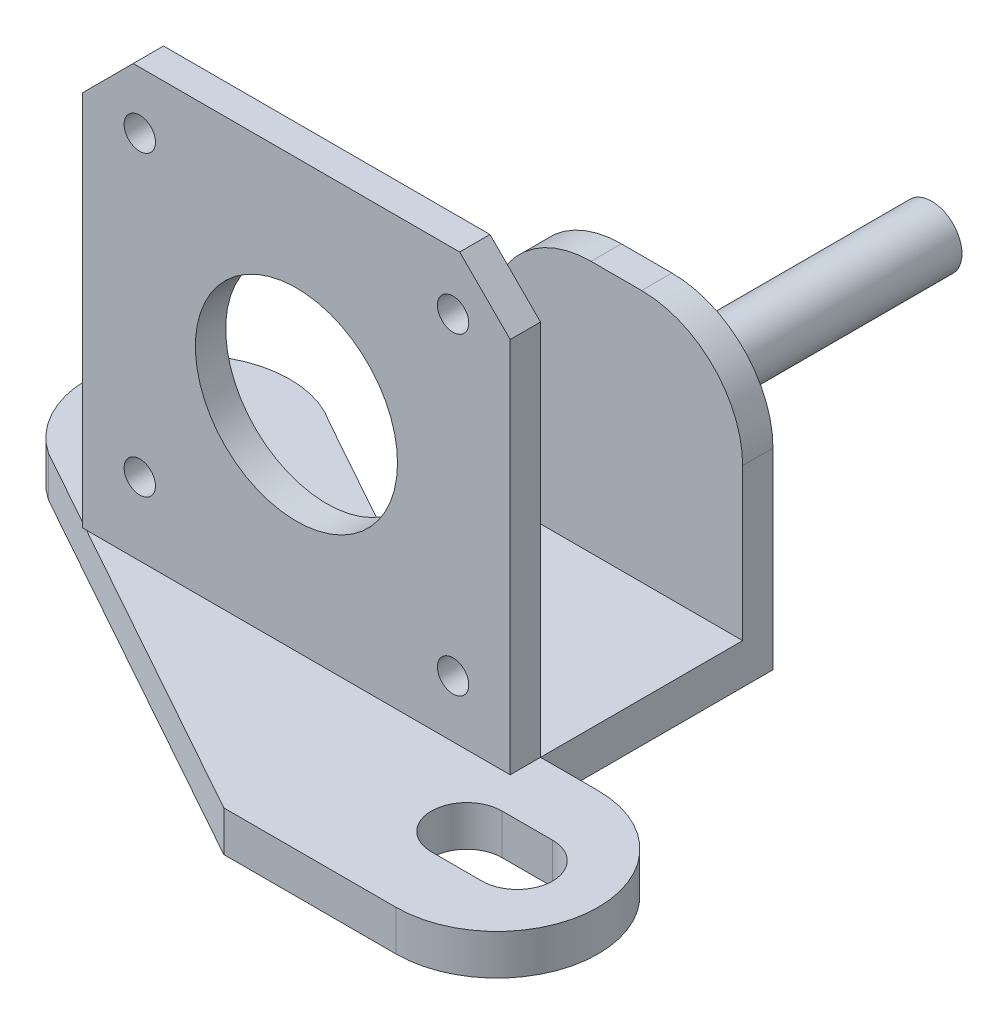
ISO-10303-21;
HEADER;
FILE_DESCRIPTION(('STEP AP214'),'2;1');
FILE_NAME('part.step','',(''),(''),'','','');
FILE_SCHEMA(('AUTOMOTIVE_DESIGN { 1 0 10303 214 1 1 1 1 }'));
ENDSEC;
DATA;
#1=APPLICATION_CONTEXT('core data for automotive mechanical design processes');
#2=APPLICATION_PROTOCOL_DEFINITION('international standard','automotive_design',2000,#1);
#3=PRODUCT_CONTEXT('',#1,'mechanical');
#4=PRODUCT('Part','Part','',(#3));
#5=PRODUCT_RELATED_PRODUCT_CATEGORY('part','',(#4));
#6=PRODUCT_DEFINITION_FORMATION('','',#4);
#7=PRODUCT_DEFINITION_CONTEXT('part definition',#1,'design');
#8=PRODUCT_DEFINITION('design','',#6,#7);
#9=PRODUCT_DEFINITION_SHAPE('','',#8);
#10=(LENGTH_UNIT() NAMED_UNIT(*) SI_UNIT(.MILLI.,.METRE.));
#11=(NAMED_UNIT(*) PLANE_ANGLE_UNIT() SI_UNIT($,.RADIAN.));
#12=(NAMED_UNIT(*) SI_UNIT($,.STERADIAN.) SOLID_ANGLE_UNIT());
#13=UNCERTAINTY_MEASURE_WITH_UNIT(LENGTH_MEASURE(1.E-05),#10,'distance_accuracy_value','');
#14=(GEOMETRIC_REPRESENTATION_CONTEXT(3) GLOBAL_UNCERTAINTY_ASSIGNED_CONTEXT((#13)) GLOBAL_UNIT_ASSIGNED_CONTEXT((#10,
#11,#12)) REPRESENTATION_CONTEXT('',''));
#15=CARTESIAN_POINT('',(0.,0.,0.));
#16=DIRECTION('',(0.,0.,1.));
#17=DIRECTION('',(1.,0.,0.));
#18=AXIS2_PLACEMENT_3D('',#15,#16,#17);
#19=CARTESIAN_POINT('',(8.14999999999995,40.65,3.));
#20=DIRECTION('',(0.,0.,1.));
#21=DIRECTION('',(1.,0.,0.));
#22=AXIS2_PLACEMENT_3D('',#19,#20,#21);
#23=CYLINDRICAL_SURFACE('',#22,1.55000000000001);
#24=CARTESIAN_POINT('',(8.14999999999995,40.65,10.));
#25=DIRECTION('',(0.,0.,1.));
#26=DIRECTION('',(1.,0.,0.));
#27=AXIS2_PLACEMENT_3D('',#24,#25,#26);
#28=CIRCLE('',#27,1.55000000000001);
#29=CARTESIAN_POINT('',(9.69999999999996,40.65,10.));
#30=VERTEX_POINT('',#29);
#31=EDGE_CURVE('E260',#30,#30,#28,.F.);
#32=ORIENTED_EDGE('',*,*,#31,.T.);
#33=EDGE_LOOP('',(#32));
#34=FACE_BOUND('',#33,.T.);
#35=CARTESIAN_POINT('',(8.14999999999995,40.65,13.));
#36=DIRECTION('',(0.,0.,1.));
#37=DIRECTION('',(1.,0.,0.));
#38=AXIS2_PLACEMENT_3D('',#35,#36,#37);
#39=CIRCLE('',#38,1.55000000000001);
#40=CARTESIAN_POINT('',(9.69999999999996,40.65,13.));
#41=VERTEX_POINT('',#40);
#42=EDGE_CURVE('E167',#41,#41,#39,.T.);
#43=ORIENTED_EDGE('',*,*,#42,.T.);
#44=EDGE_LOOP('',(#43));
#45=FACE_BOUND('',#44,.T.);
#46=ADVANCED_FACE('F17',(#34,#45),#23,.F.);
#47=CARTESIAN_POINT('',(23.65,25.15,3.));
#48=DIRECTION('',(0.,0.,1.));
#49=DIRECTION('',(1.,0.,0.));
#50=AXIS2_PLACEMENT_3D('',#47,#48,#49);
#51=CYLINDRICAL_SURFACE('',#50,9.99999999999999);
#52=CARTESIAN_POINT('',(23.65,25.15,10.));
#53=DIRECTION('',(0.,0.,1.));
#54=DIRECTION('',(1.,0.,0.));
#55=AXIS2_PLACEMENT_3D('',#52,#53,#54);
#56=CIRCLE('',#55,9.99999999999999);
#57=CARTESIAN_POINT('',(33.65,25.15,10.));
#58=VERTEX_POINT('',#57);
#59=EDGE_CURVE('E257',#58,#58,#56,.F.);
#60=ORIENTED_EDGE('',*,*,#59,.T.);
#61=EDGE_LOOP('',(#60));
#62=FACE_BOUND('',#61,.T.);
#63=CARTESIAN_POINT('',(23.65,25.15,13.));
#64=DIRECTION('',(0.,0.,1.));
#65=DIRECTION('',(1.,0.,0.));
#66=AXIS2_PLACEMENT_3D('',#63,#64,#65);
#67=CIRCLE('',#66,9.99999999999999);
#68=CARTESIAN_POINT('',(33.65,25.15,13.));
#69=VERTEX_POINT('',#68);
#70=EDGE_CURVE('E265',#69,#69,#67,.T.);
#71=ORIENTED_EDGE('',*,*,#70,.T.);
#72=EDGE_LOOP('',(#71));
#73=FACE_BOUND('',#72,.T.);
#74=ADVANCED_FACE('F604',(#62,#73),#51,.F.);
#75=CARTESIAN_POINT('',(39.1499999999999,9.64999999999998,3.));
#76=DIRECTION('',(0.,0.,1.));
#77=DIRECTION('',(1.,0.,0.));
#78=AXIS2_PLACEMENT_3D('',#75,#76,#77);
#79=CYLINDRICAL_SURFACE('',#78,1.55000000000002);
#80=CARTESIAN_POINT('',(39.1499999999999,9.64999999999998,10.));
#81=DIRECTION('',(0.,0.,1.));
#82=DIRECTION('',(1.,0.,0.));
#83=AXIS2_PLACEMENT_3D('',#80,#81,#82);
#84=CIRCLE('',#83,1.55000000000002);
#85=CARTESIAN_POINT('',(40.7,9.64999999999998,10.));
#86=VERTEX_POINT('',#85);
#87=EDGE_CURVE('E254',#86,#86,#84,.F.);
#88=ORIENTED_EDGE('',*,*,#87,.T.);
#89=EDGE_LOOP('',(#88));
#90=FACE_BOUND('',#89,.T.);
#91=CARTESIAN_POINT('',(39.1499999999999,9.64999999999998,13.));
#92=DIRECTION('',(0.,0.,1.));
#93=DIRECTION('',(1.,0.,0.));
#94=AXIS2_PLACEMENT_3D('',#91,#92,#93);
#95=CIRCLE('',#94,1.55000000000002);
#96=CARTESIAN_POINT('',(40.7,9.64999999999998,13.));
#97=VERTEX_POINT('',#96);
#98=EDGE_CURVE('E268',#97,#97,#95,.T.);
#99=ORIENTED_EDGE('',*,*,#98,.T.);
#100=EDGE_LOOP('',(#99));
#101=FACE_BOUND('',#100,.T.);
#102=ADVANCED_FACE('F601',(#90,#101),#79,.F.);
#103=CARTESIAN_POINT('',(39.1499999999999,40.65,3.));
#104=DIRECTION('',(0.,0.,1.));
#105=DIRECTION('',(1.,0.,0.));
#106=AXIS2_PLACEMENT_3D('',#103,#104,#105);
#107=CYLINDRICAL_SURFACE('',#106,1.55000000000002);
#108=CARTESIAN_POINT('',(39.1499999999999,40.65,10.));
#109=DIRECTION('',(0.,0.,1.));
#110=DIRECTION('',(1.,0.,0.));
#111=AXIS2_PLACEMENT_3D('',#108,#109,#110);
#112=CIRCLE('',#111,1.55000000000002);
#113=CARTESIAN_POINT('',(40.7,40.65,10.));
#114=VERTEX_POINT('',#113);
#115=EDGE_CURVE('E251',#114,#114,#112,.F.);
#116=ORIENTED_EDGE('',*,*,#115,.T.);
#117=EDGE_LOOP('',(#116));
#118=FACE_BOUND('',#117,.T.);
#119=CARTESIAN_POINT('',(39.1499999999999,40.65,13.));
#120=DIRECTION('',(0.,0.,1.));
#121=DIRECTION('',(1.,0.,0.));
#122=AXIS2_PLACEMENT_3D('',#119,#120,#121);
#123=CIRCLE('',#122,1.55000000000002);
#124=CARTESIAN_POINT('',(40.7,40.65,13.));
#125=VERTEX_POINT('',#124);
#126=EDGE_CURVE('E270',#125,#125,#123,.T.);
#127=ORIENTED_EDGE('',*,*,#126,.T.);
#128=EDGE_LOOP('',(#127));
#129=FACE_BOUND('',#128,.T.);
#130=ADVANCED_FACE('F597',(#118,#129),#107,.F.);
#131=CARTESIAN_POINT('',(8.14999999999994,11.2,3.));
#132=DIRECTION('',(0.,0.,1.));
#133=DIRECTION('',(1.,0.,0.));
#134=AXIS2_PLACEMENT_3D('',#131,#132,#133);
#135=CYLINDRICAL_SURFACE('',#134,1.55000000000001);
#136=CARTESIAN_POINT('',(8.14999999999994,11.2,10.));
#137=DIRECTION('',(0.,0.,1.));
#138=DIRECTION('',(1.,0.,0.));
#139=AXIS2_PLACEMENT_3D('',#136,#137,#138);
#140=CIRCLE('',#139,1.55000000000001);
#141=CARTESIAN_POINT('',(9.69999999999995,11.2,10.));
#142=VERTEX_POINT('',#141);
#143=EDGE_CURVE('E248',#142,#142,#140,.F.);
#144=ORIENTED_EDGE('',*,*,#143,.T.);
#145=EDGE_LOOP('',(#144));
#146=FACE_BOUND('',#145,.T.);
#147=CARTESIAN_POINT('',(8.14999999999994,11.2,13.));
#148=DIRECTION('',(0.,0.,1.));
#149=DIRECTION('',(1.,0.,0.));
#150=AXIS2_PLACEMENT_3D('',#147,#148,#149);
#151=CIRCLE('',#150,1.55000000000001);
#152=CARTESIAN_POINT('',(9.69999999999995,11.2,13.));
#153=VERTEX_POINT('',#152);
#154=EDGE_CURVE('E20',#153,#153,#151,.T.);
#155=ORIENTED_EDGE('',*,*,#154,.T.);
#156=EDGE_LOOP('',(#155));
#157=FACE_BOUND('',#156,.T.);
#158=ADVANCED_FACE('F594',(#146,#157),#135,.F.);
#159=CARTESIAN_POINT('',(39.8,46.3,0.));
#160=DIRECTION('',(-0.707106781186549,-0.707106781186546,0.));
#161=DIRECTION('',(0.707106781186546,-0.707106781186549,0.));
#162=AXIS2_PLACEMENT_3D('',#159,#160,#161);
#163=PLANE('',#162);
#164=DIRECTION('',(0.,0.,1.));
#165=VECTOR('',#164,1.);
#166=CARTESIAN_POINT('',(44.8,41.3,10.));
#167=LINE('',#166,#165);
#168=CARTESIAN_POINT('',(44.8,41.3,13.));
#169=VERTEX_POINT('',#168);
#170=CARTESIAN_POINT('',(44.8,41.3,10.));
#171=VERTEX_POINT('',#170);
#172=EDGE_CURVE('E275',#169,#171,#167,.F.);
#173=ORIENTED_EDGE('',*,*,#172,.T.);
#174=DIRECTION('',(-0.707106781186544,0.70710678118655,0.));
#175=VECTOR('',#174,1.);
#176=CARTESIAN_POINT('',(44.8,41.3,10.));
#177=LINE('',#176,#175);
#178=CARTESIAN_POINT('',(39.8,46.3,10.));
#179=VERTEX_POINT('',#178);
#180=EDGE_CURVE('E173',#171,#179,#177,.T.);
#181=ORIENTED_EDGE('',*,*,#180,.T.);
#182=DIRECTION('',(0.,0.,-1.));
#183=VECTOR('',#182,1.);
#184=CARTESIAN_POINT('',(39.8,46.3,0.));
#185=LINE('',#184,#183);
#186=CARTESIAN_POINT('',(39.8,46.3,13.));
#187=VERTEX_POINT('',#186);
#188=EDGE_CURVE('E171',#179,#187,#185,.F.);
#189=ORIENTED_EDGE('',*,*,#188,.T.);
#190=DIRECTION('',(0.707106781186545,-0.70710678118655,0.));
#191=VECTOR('',#190,1.);
#192=CARTESIAN_POINT('',(39.8,46.3,13.));
#193=LINE('',#192,#191);
#194=EDGE_CURVE('E155',#187,#169,#193,.T.);
#195=ORIENTED_EDGE('',*,*,#194,.T.);
#196=EDGE_LOOP('',(#173,#181,#189,#195));
#197=FACE_BOUND('',#196,.T.);
#198=ADVANCED_FACE('F172',(#197),#163,.F.);
#199=CARTESIAN_POINT('',(0.,46.3,0.));
#200=DIRECTION('',(0.,-1.,0.));
#201=DIRECTION('',(0.,0.,-1.));
#202=AXIS2_PLACEMENT_3D('',#199,#200,#201);
#203=PLANE('',#202);
#204=DIRECTION('',(0.,0.,1.));
#205=VECTOR('',#204,1.);
#206=CARTESIAN_POINT('',(7.49999999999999,46.3,0.));
#207=LINE('',#206,#205);
#208=CARTESIAN_POINT('',(7.49999999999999,46.3,10.));
#209=VERTEX_POINT('',#208);
#210=CARTESIAN_POINT('',(7.49999999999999,46.3,13.));
#211=VERTEX_POINT('',#210);
#212=EDGE_CURVE('E177',#209,#211,#207,.T.);
#213=ORIENTED_EDGE('',*,*,#212,.T.);
#214=DIRECTION('',(-1.,0.,0.));
#215=VECTOR('',#214,1.);
#216=CARTESIAN_POINT('',(44.8,46.3,13.));
#217=LINE('',#216,#215);
#218=EDGE_CURVE('E160',#211,#187,#217,.F.);
#219=ORIENTED_EDGE('',*,*,#218,.T.);
#220=ORIENTED_EDGE('',*,*,#188,.F.);
#221=DIRECTION('',(1.,0.,0.));
#222=VECTOR('',#221,1.);
#223=CARTESIAN_POINT('',(0.,46.3,10.));
#224=LINE('',#223,#222);
#225=EDGE_CURVE('E288',#179,#209,#224,.F.);
#226=ORIENTED_EDGE('',*,*,#225,.T.);
#227=EDGE_LOOP('',(#213,#219,#220,#226));
#228=FACE_BOUND('',#227,.T.);
#229=ADVANCED_FACE('F179',(#228),#203,.F.);
#230=CARTESIAN_POINT('',(7.49999999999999,46.3,0.));
#231=DIRECTION('',(0.70710678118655,-0.707106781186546,0.));
#232=DIRECTION('',(0.707106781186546,0.70710678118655,0.));
#233=AXIS2_PLACEMENT_3D('',#230,#231,#232);
#234=PLANE('',#233);
#235=DIRECTION('',(0.,0.,-1.));
#236=VECTOR('',#235,1.);
#237=CARTESIAN_POINT('',(2.5,41.3,13.));
#238=LINE('',#237,#236);
#239=CARTESIAN_POINT('',(2.5,41.3,10.));
#240=VERTEX_POINT('',#239);
#241=CARTESIAN_POINT('',(2.5,41.3,13.));
#242=VERTEX_POINT('',#241);
#243=EDGE_CURVE('E180',#240,#242,#238,.F.);
#244=ORIENTED_EDGE('',*,*,#243,.T.);
#245=DIRECTION('',(0.707106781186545,0.70710678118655,0.));
#246=VECTOR('',#245,1.);
#247=CARTESIAN_POINT('',(2.5,41.3,13.));
#248=LINE('',#247,#246);
#249=EDGE_CURVE('E181',#242,#211,#248,.T.);
#250=ORIENTED_EDGE('',*,*,#249,.T.);
#251=ORIENTED_EDGE('',*,*,#212,.F.);
#252=DIRECTION('',(-0.707106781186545,-0.707106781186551,0.));
#253=VECTOR('',#252,1.);
#254=CARTESIAN_POINT('',(7.49999999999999,46.3,10.));
#255=LINE('',#254,#253);
#256=EDGE_CURVE('E293',#209,#240,#255,.T.);
#257=ORIENTED_EDGE('',*,*,#256,.T.);
#258=EDGE_LOOP('',(#244,#250,#251,#257));
#259=FACE_BOUND('',#258,.T.);
#260=ADVANCED_FACE('F314',(#259),#234,.F.);
#261=CARTESIAN_POINT('',(35.49872900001,20.000000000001,-38.));
#262=DIRECTION('',(0.,0.,-1.));
#263=DIRECTION('',(-1.,0.,0.));
#264=AXIS2_PLACEMENT_3D('',#261,#262,#263);
#265=PLANE('',#264);
#266=CARTESIAN_POINT('',(35.49872900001,20.000000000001,-38.));
#267=DIRECTION('',(0.,0.,1.));
#268=DIRECTION('',(1.,0.,0.));
#269=AXIS2_PLACEMENT_3D('',#266,#267,#268);
#270=CIRCLE('',#269,3.);
#271=CARTESIAN_POINT('',(38.49872900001,20.000000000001,-38.));
#272=VERTEX_POINT('',#271);
#273=EDGE_CURVE('E244',#272,#272,#270,.T.);
#274=ORIENTED_EDGE('',*,*,#273,.F.);
#275=EDGE_LOOP('',(#274));
#276=FACE_BOUND('',#275,.T.);
#277=ADVANCED_FACE('F583',(#276),#265,.T.);
#278=CARTESIAN_POINT('',(44.8,46.3,10.));
#279=DIRECTION('',(-1.,0.,0.));
#280=DIRECTION('',(0.,0.,1.));
#281=AXIS2_PLACEMENT_3D('',#278,#279,#280);
#282=PLANE('',#281);
#283=ORIENTED_EDGE('',*,*,#172,.F.);
#284=DIRECTION('',(0.,1.,0.));
#285=VECTOR('',#284,1.);
#286=CARTESIAN_POINT('',(44.8,46.3,13.));
#287=LINE('',#286,#285);
#288=CARTESIAN_POINT('',(44.8,4.,13.));
#289=VERTEX_POINT('',#288);
#290=EDGE_CURVE('E164',#169,#289,#287,.F.);
#291=ORIENTED_EDGE('',*,*,#290,.T.);
#292=DIRECTION('',(0.,0.,1.));
#293=VECTOR('',#292,1.);
#294=CARTESIAN_POINT('',(44.8,4.,0.));
#295=LINE('',#294,#293);
#296=CARTESIAN_POINT('',(44.8,4.,10.));
#297=VERTEX_POINT('',#296);
#298=EDGE_CURVE('E360',#297,#289,#295,.T.);
#299=ORIENTED_EDGE('',*,*,#298,.F.);
#300=DIRECTION('',(0.,1.,0.));
#301=VECTOR('',#300,1.);
#302=CARTESIAN_POINT('',(44.8,4.,10.));
#303=LINE('',#302,#301);
#304=EDGE_CURVE('E328',#297,#171,#303,.T.);
#305=ORIENTED_EDGE('',*,*,#304,.T.);
#306=EDGE_LOOP('',(#283,#291,#299,#305));
#307=FACE_BOUND('',#306,.T.);
#308=ADVANCED_FACE('F580',(#307),#282,.F.);
#309=CARTESIAN_POINT('',(44.8,46.3,13.));
#310=DIRECTION('',(0.,0.,-1.));
#311=DIRECTION('',(-1.,0.,0.));
#312=AXIS2_PLACEMENT_3D('',#309,#310,#311);
#313=PLANE('',#312);
#314=ORIENTED_EDGE('',*,*,#249,.F.);
#315=DIRECTION('',(0.,1.,0.));
#316=VECTOR('',#315,1.);
#317=CARTESIAN_POINT('',(2.5,46.3,13.));
#318=LINE('',#317,#316);
#319=CARTESIAN_POINT('',(2.5,4.,13.));
#320=VERTEX_POINT('',#319);
#321=EDGE_CURVE('E128',#242,#320,#318,.F.);
#322=ORIENTED_EDGE('',*,*,#321,.T.);
#323=DIRECTION('',(1.,0.,0.));
#324=VECTOR('',#323,1.);
#325=CARTESIAN_POINT('',(0.,4.,13.));
#326=LINE('',#325,#324);
#327=CARTESIAN_POINT('',(2.88010316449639,4.,13.));
#328=VERTEX_POINT('',#327);
#329=EDGE_CURVE('E247',#328,#320,#326,.F.);
#330=ORIENTED_EDGE('',*,*,#329,.F.);
#331=DIRECTION('',(1.,0.,0.));
#332=VECTOR('',#331,1.);
#333=CARTESIAN_POINT('',(0.,4.,13.));
#334=LINE('',#333,#332);
#335=EDGE_CURVE('E357',#289,#328,#334,.F.);
#336=ORIENTED_EDGE('',*,*,#335,.F.);
#337=ORIENTED_EDGE('',*,*,#290,.F.);
#338=ORIENTED_EDGE('',*,*,#194,.F.);
#339=ORIENTED_EDGE('',*,*,#218,.F.);
#340=EDGE_LOOP('',(#314,#322,#330,#336,#337,#338,#339));
#341=FACE_BOUND('',#340,.T.);
#342=ORIENTED_EDGE('',*,*,#42,.F.);
#343=EDGE_LOOP('',(#342));
#344=FACE_BOUND('',#343,.T.);
#345=ORIENTED_EDGE('',*,*,#70,.F.);
#346=EDGE_LOOP('',(#345));
#347=FACE_BOUND('',#346,.T.);
#348=ORIENTED_EDGE('',*,*,#98,.F.);
#349=EDGE_LOOP('',(#348));
#350=FACE_BOUND('',#349,.T.);
#351=ORIENTED_EDGE('',*,*,#126,.F.);
#352=EDGE_LOOP('',(#351));
#353=FACE_BOUND('',#352,.T.);
#354=ORIENTED_EDGE('',*,*,#154,.F.);
#355=EDGE_LOOP('',(#354));
#356=FACE_BOUND('',#355,.T.);
#357=ADVANCED_FACE('F157',(#341,#344,#347,#350,#353,#356),#313,.F.);
#358=CARTESIAN_POINT('',(2.5,46.3,13.));
#359=DIRECTION('',(1.,0.,0.));
#360=DIRECTION('',(0.,0.,-1.));
#361=AXIS2_PLACEMENT_3D('',#358,#359,#360);
#362=PLANE('',#361);
#363=ORIENTED_EDGE('',*,*,#243,.F.);
#364=DIRECTION('',(0.,1.,0.));
#365=VECTOR('',#364,1.);
#366=CARTESIAN_POINT('',(2.5,4.,10.));
#367=LINE('',#366,#365);
#368=CARTESIAN_POINT('',(2.5,4.,10.));
#369=VERTEX_POINT('',#368);
#370=EDGE_CURVE('E296',#240,#369,#367,.F.);
#371=ORIENTED_EDGE('',*,*,#370,.T.);
#372=DIRECTION('',(0.,0.,1.));
#373=VECTOR('',#372,1.);
#374=CARTESIAN_POINT('',(2.5,4.,0.));
#375=LINE('',#374,#373);
#376=CARTESIAN_POINT('',(2.5,4.,12.7887300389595));
#377=VERTEX_POINT('',#376);
#378=EDGE_CURVE('E334',#377,#369,#375,.F.);
#379=ORIENTED_EDGE('',*,*,#378,.F.);
#380=DIRECTION('',(0.,0.,-1.));
#381=VECTOR('',#380,1.);
#382=CARTESIAN_POINT('',(2.5,4.,0.));
#383=LINE('',#382,#381);
#384=EDGE_CURVE('E320',#320,#377,#383,.T.);
#385=ORIENTED_EDGE('',*,*,#384,.F.);
#386=ORIENTED_EDGE('',*,*,#321,.F.);
#387=EDGE_LOOP('',(#363,#371,#379,#385,#386));
#388=FACE_BOUND('',#387,.T.);
#389=ADVANCED_FACE('F317',(#388),#362,.F.);
#390=CARTESIAN_POINT('',(0.,4.,10.));
#391=DIRECTION('',(0.,0.,1.));
#392=DIRECTION('',(1.,0.,0.));
#393=AXIS2_PLACEMENT_3D('',#390,#391,#392);
#394=PLANE('',#393);
#395=DIRECTION('',(1.,0.,0.));
#396=VECTOR('',#395,1.);
#397=CARTESIAN_POINT('',(0.,4.,10.));
#398=LINE('',#397,#396);
#399=EDGE_CURVE('E236',#369,#297,#398,.T.);
#400=ORIENTED_EDGE('',*,*,#399,.F.);
#401=ORIENTED_EDGE('',*,*,#370,.F.);
#402=ORIENTED_EDGE('',*,*,#256,.F.);
#403=ORIENTED_EDGE('',*,*,#225,.F.);
#404=ORIENTED_EDGE('',*,*,#180,.F.);
#405=ORIENTED_EDGE('',*,*,#304,.F.);
#406=EDGE_LOOP('',(#400,#401,#402,#403,#404,#405));
#407=FACE_BOUND('',#406,.T.);
#408=ORIENTED_EDGE('',*,*,#143,.F.);
#409=EDGE_LOOP('',(#408));
#410=FACE_BOUND('',#409,.T.);
#411=ORIENTED_EDGE('',*,*,#115,.F.);
#412=EDGE_LOOP('',(#411));
#413=FACE_BOUND('',#412,.T.);
#414=ORIENTED_EDGE('',*,*,#87,.F.);
#415=EDGE_LOOP('',(#414));
#416=FACE_BOUND('',#415,.T.);
#417=ORIENTED_EDGE('',*,*,#59,.F.);
#418=EDGE_LOOP('',(#417));
#419=FACE_BOUND('',#418,.T.);
#420=ORIENTED_EDGE('',*,*,#31,.F.);
#421=EDGE_LOOP('',(#420));
#422=FACE_BOUND('',#421,.T.);
#423=ADVANCED_FACE('F308',(#407,#410,#413,#416,#419,#422),#394,.F.);
#424=CARTESIAN_POINT('',(0.,4.,0.));
#425=DIRECTION('',(0.,-1.,0.));
#426=DIRECTION('',(0.,0.,-1.));
#427=AXIS2_PLACEMENT_3D('',#424,#425,#426);
#428=PLANE('',#427);
#429=DIRECTION('',(-0.874058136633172,0.,-0.485821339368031));
#430=VECTOR('',#429,1.);
#431=CARTESIAN_POINT('',(-4.84050044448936,4.,8.70871338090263));
#432=LINE('',#431,#430);
#433=EDGE_CURVE('E343',#377,#328,#432,.F.);
#434=ORIENTED_EDGE('',*,*,#433,.T.);
#435=ORIENTED_EDGE('',*,*,#329,.T.);
#436=ORIENTED_EDGE('',*,*,#384,.T.);
#437=EDGE_LOOP('',(#434,#435,#436));
#438=FACE_BOUND('',#437,.T.);
#439=ADVANCED_FACE('F569',(#438),#428,.T.);
#440=CARTESIAN_POINT('',(35.49872900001,20.000000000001,-38.));
#441=DIRECTION('',(0.,0.,1.));
#442=DIRECTION('',(1.,0.,0.));
#443=AXIS2_PLACEMENT_3D('',#440,#441,#442);
#444=CYLINDRICAL_SURFACE('',#443,3.);
#445=CARTESIAN_POINT('',(35.49872900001,20.000000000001,-13.));
#446=DIRECTION('',(0.,0.,1.));
#447=DIRECTION('',(1.,0.,0.));
#448=AXIS2_PLACEMENT_3D('',#445,#446,#447);
#449=CIRCLE('',#448,3.);
#450=CARTESIAN_POINT('',(38.4987290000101,20.000000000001,-13.));
#451=VERTEX_POINT('',#450);
#452=EDGE_CURVE('E225',#451,#451,#449,.T.);
#453=ORIENTED_EDGE('',*,*,#452,.F.);
#454=EDGE_LOOP('',(#453));
#455=FACE_BOUND('',#454,.T.);
#456=ORIENTED_EDGE('',*,*,#273,.T.);
#457=EDGE_LOOP('',(#456));
#458=FACE_BOUND('',#457,.T.);
#459=ADVANCED_FACE('F565',(#455,#458),#444,.T.);
#460=CARTESIAN_POINT('',(0.,29.,0.));
#461=DIRECTION('',(0.,1.,0.));
#462=DIRECTION('',(0.,0.,1.));
#463=AXIS2_PLACEMENT_3D('',#460,#461,#462);
#464=PLANE('',#463);
#465=DIRECTION('',(-1.,0.,0.));
#466=VECTOR('',#465,1.);
#467=CARTESIAN_POINT('',(19.8,29.,-9.99999999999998));
#468=LINE('',#467,#466);
#469=CARTESIAN_POINT('',(29.8,29.,-9.99999999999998));
#470=VERTEX_POINT('',#469);
#471=CARTESIAN_POINT('',(34.8,29.,-9.99999999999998));
#472=VERTEX_POINT('',#471);
#473=EDGE_CURVE('E240',#470,#472,#468,.F.);
#474=ORIENTED_EDGE('',*,*,#473,.T.);
#475=DIRECTION('',(0.,0.,1.));
#476=VECTOR('',#475,1.);
#477=CARTESIAN_POINT('',(34.8,29.,0.));
#478=LINE('',#477,#476);
#479=CARTESIAN_POINT('',(34.8,29.,-13.));
#480=VERTEX_POINT('',#479);
#481=EDGE_CURVE('E119',#480,#472,#478,.T.);
#482=ORIENTED_EDGE('',*,*,#481,.F.);
#483=DIRECTION('',(-1.,0.,0.));
#484=VECTOR('',#483,1.);
#485=CARTESIAN_POINT('',(0.,29.,-13.));
#486=LINE('',#485,#484);
#487=CARTESIAN_POINT('',(29.8,29.,-13.));
#488=VERTEX_POINT('',#487);
#489=EDGE_CURVE('E221',#488,#480,#486,.F.);
#490=ORIENTED_EDGE('',*,*,#489,.F.);
#491=DIRECTION('',(0.,0.,-1.));
#492=VECTOR('',#491,1.);
#493=CARTESIAN_POINT('',(29.8,29.,0.));
#494=LINE('',#493,#492);
#495=EDGE_CURVE('E243',#470,#488,#494,.T.);
#496=ORIENTED_EDGE('',*,*,#495,.F.);
#497=EDGE_LOOP('',(#474,#482,#490,#496));
#498=FACE_BOUND('',#497,.T.);
#499=ADVANCED_FACE('F562',(#498),#464,.T.);
#500=CARTESIAN_POINT('',(34.8,19.,0.));
#501=DIRECTION('',(0.,0.,1.));
#502=DIRECTION('',(1.,0.,0.));
#503=AXIS2_PLACEMENT_3D('',#500,#501,#502);
#504=CYLINDRICAL_SURFACE('',#503,10.);
#505=CARTESIAN_POINT('',(34.8,19.,-13.));
#506=DIRECTION('',(0.,0.,1.));
#507=DIRECTION('',(1.,0.,0.));
#508=AXIS2_PLACEMENT_3D('',#505,#506,#507);
#509=CIRCLE('',#508,10.);
#510=CARTESIAN_POINT('',(44.8,19.,-13.));
#511=VERTEX_POINT('',#510);
#512=EDGE_CURVE('E218',#480,#511,#509,.F.);
#513=ORIENTED_EDGE('',*,*,#512,.F.);
#514=ORIENTED_EDGE('',*,*,#481,.T.);
#515=CARTESIAN_POINT('',(34.8,19.,-9.99999999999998));
#516=DIRECTION('',(0.,0.,1.));
#517=DIRECTION('',(1.,0.,0.));
#518=AXIS2_PLACEMENT_3D('',#515,#516,#517);
#519=CIRCLE('',#518,10.);
#520=CARTESIAN_POINT('',(44.8,19.,-9.99999999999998));
#521=VERTEX_POINT('',#520);
#522=EDGE_CURVE('E241',#472,#521,#519,.F.);
#523=ORIENTED_EDGE('',*,*,#522,.T.);
#524=DIRECTION('',(0.,0.,1.));
#525=VECTOR('',#524,1.);
#526=CARTESIAN_POINT('',(44.8,19.,-13.));
#527=LINE('',#526,#525);
#528=EDGE_CURVE('E228',#521,#511,#527,.F.);
#529=ORIENTED_EDGE('',*,*,#528,.T.);
#530=EDGE_LOOP('',(#513,#514,#523,#529));
#531=FACE_BOUND('',#530,.T.);
#532=ADVANCED_FACE('F558',(#531),#504,.T.);
#533=CARTESIAN_POINT('',(29.8,19.,0.));
#534=DIRECTION('',(0.,0.,-1.));
#535=DIRECTION('',(-1.,0.,0.));
#536=AXIS2_PLACEMENT_3D('',#533,#534,#535);
#537=CYLINDRICAL_SURFACE('',#536,10.);
#538=CARTESIAN_POINT('',(29.8,19.,-9.99999999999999));
#539=DIRECTION('',(0.,0.,-1.));
#540=DIRECTION('',(-1.,0.,0.));
#541=AXIS2_PLACEMENT_3D('',#538,#539,#540);
#542=CIRCLE('',#541,10.);
#543=CARTESIAN_POINT('',(19.8,19.,-9.99999999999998));
#544=VERTEX_POINT('',#543);
#545=EDGE_CURVE('E237',#544,#470,#542,.T.);
#546=ORIENTED_EDGE('',*,*,#545,.T.);
#547=ORIENTED_EDGE('',*,*,#495,.T.);
#548=CARTESIAN_POINT('',(29.8,19.,-13.));
#549=DIRECTION('',(0.,0.,-1.));
#550=DIRECTION('',(-1.,0.,0.));
#551=AXIS2_PLACEMENT_3D('',#548,#549,#550);
#552=CIRCLE('',#551,10.);
#553=CARTESIAN_POINT('',(19.8,19.,-13.));
#554=VERTEX_POINT('',#553);
#555=EDGE_CURVE('E222',#554,#488,#552,.T.);
#556=ORIENTED_EDGE('',*,*,#555,.F.);
#557=DIRECTION('',(0.,0.,-1.));
#558=VECTOR('',#557,1.);
#559=CARTESIAN_POINT('',(19.8,19.,-13.));
#560=LINE('',#559,#558);
#561=EDGE_CURVE('E408',#554,#544,#560,.F.);
#562=ORIENTED_EDGE('',*,*,#561,.T.);
#563=EDGE_LOOP('',(#546,#547,#556,#562));
#564=FACE_BOUND('',#563,.T.);
#565=ADVANCED_FACE('F554',(#564),#537,.T.);
#566=CARTESIAN_POINT('',(19.8,29.,-9.99999999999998));
#567=DIRECTION('',(0.,0.,-1.));
#568=DIRECTION('',(-1.,0.,0.));
#569=AXIS2_PLACEMENT_3D('',#566,#567,#568);
#570=PLANE('',#569);
#571=ORIENTED_EDGE('',*,*,#545,.F.);
#572=DIRECTION('',(0.,1.,0.));
#573=VECTOR('',#572,1.);
#574=CARTESIAN_POINT('',(19.8,4.,-9.99999999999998));
#575=LINE('',#574,#573);
#576=CARTESIAN_POINT('',(19.8,4.,-9.99999999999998));
#577=VERTEX_POINT('',#576);
#578=EDGE_CURVE('E404',#544,#577,#575,.F.);
#579=ORIENTED_EDGE('',*,*,#578,.T.);
#580=DIRECTION('',(1.,0.,0.));
#581=VECTOR('',#580,1.);
#582=CARTESIAN_POINT('',(0.,4.,-9.99999999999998));
#583=LINE('',#582,#581);
#584=CARTESIAN_POINT('',(44.8,4.,-9.99999999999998));
#585=VERTEX_POINT('',#584);
#586=EDGE_CURVE('E337',#585,#577,#583,.F.);
#587=ORIENTED_EDGE('',*,*,#586,.F.);
#588=DIRECTION('',(0.,1.,0.));
#589=VECTOR('',#588,1.);
#590=CARTESIAN_POINT('',(44.8,4.,-9.99999999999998));
#591=LINE('',#590,#589);
#592=EDGE_CURVE('E389',#585,#521,#591,.T.);
#593=ORIENTED_EDGE('',*,*,#592,.T.);
#594=ORIENTED_EDGE('',*,*,#522,.F.);
#595=ORIENTED_EDGE('',*,*,#473,.F.);
#596=EDGE_LOOP('',(#571,#579,#587,#593,#594,#595));
#597=FACE_BOUND('',#596,.T.);
#598=ADVANCED_FACE('F547',(#597),#570,.F.);
#599=CARTESIAN_POINT('',(0.,4.,0.));
#600=DIRECTION('',(0.,1.,0.));
#601=DIRECTION('',(0.,0.,1.));
#602=AXIS2_PLACEMENT_3D('',#599,#600,#601);
#603=PLANE('',#602);
#604=CARTESIAN_POINT('',(47.5,4.,20.));
#605=DIRECTION('',(0.,-1.,0.));
#606=DIRECTION('',(0.,0.,-1.));
#607=AXIS2_PLACEMENT_3D('',#604,#605,#606);
#608=CIRCLE('',#607,3.5);
#609=CARTESIAN_POINT('',(47.5,4.,23.5));
#610=VERTEX_POINT('',#609);
#611=CARTESIAN_POINT('',(47.5,4.,16.5));
#612=VERTEX_POINT('',#611);
#613=EDGE_CURVE('E214',#610,#612,#608,.T.);
#614=ORIENTED_EDGE('',*,*,#613,.T.);
#615=DIRECTION('',(-1.,0.,0.));
#616=VECTOR('',#615,1.);
#617=CARTESIAN_POINT('',(0.,4.,16.5));
#618=LINE('',#617,#616);
#619=CARTESIAN_POINT('',(52.5,4.,16.5));
#620=VERTEX_POINT('',#619);
#621=EDGE_CURVE('E424',#612,#620,#618,.F.);
#622=ORIENTED_EDGE('',*,*,#621,.T.);
#623=CARTESIAN_POINT('',(52.5,4.,20.));
#624=DIRECTION('',(0.,-1.,0.));
#625=DIRECTION('',(0.,0.,-1.));
#626=AXIS2_PLACEMENT_3D('',#623,#624,#625);
#627=CIRCLE('',#626,3.5);
#628=CARTESIAN_POINT('',(52.5,4.,23.5));
#629=VERTEX_POINT('',#628);
#630=EDGE_CURVE('E211',#620,#629,#627,.T.);
#631=ORIENTED_EDGE('',*,*,#630,.T.);
#632=DIRECTION('',(-1.,0.,0.));
#633=VECTOR('',#632,1.);
#634=CARTESIAN_POINT('',(0.,4.,23.5));
#635=LINE('',#634,#633);
#636=EDGE_CURVE('E426',#610,#629,#635,.F.);
#637=ORIENTED_EDGE('',*,*,#636,.F.);
#638=EDGE_LOOP('',(#614,#622,#631,#637));
#639=FACE_BOUND('',#638,.T.);
#640=CARTESIAN_POINT('',(50.5,4.,20.));
#641=DIRECTION('',(0.,-1.,0.));
#642=DIRECTION('',(0.,0.,-1.));
#643=AXIS2_PLACEMENT_3D('',#640,#641,#642);
#644=CIRCLE('',#643,10.);
#645=CARTESIAN_POINT('',(50.5,4.,10.));
#646=VERTEX_POINT('',#645);
#647=CARTESIAN_POINT('',(50.5,4.,30.));
#648=VERTEX_POINT('',#647);
#649=EDGE_CURVE('E229',#646,#648,#644,.T.);
#650=ORIENTED_EDGE('',*,*,#649,.F.);
#651=DIRECTION('',(1.,0.,0.));
#652=VECTOR('',#651,1.);
#653=CARTESIAN_POINT('',(0.,4.,10.));
#654=LINE('',#653,#652);
#655=EDGE_CURVE('E375',#646,#297,#654,.F.);
#656=ORIENTED_EDGE('',*,*,#655,.T.);
#657=ORIENTED_EDGE('',*,*,#298,.T.);
#658=ORIENTED_EDGE('',*,*,#335,.T.);
#659=DIRECTION('',(-0.874058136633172,0.,-0.485821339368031));
#660=VECTOR('',#659,1.);
#661=CARTESIAN_POINT('',(-4.84050044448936,4.,8.70871338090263));
#662=LINE('',#661,#660);
#663=CARTESIAN_POINT('',(33.4653968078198,4.,30.));
#664=VERTEX_POINT('',#663);
#665=EDGE_CURVE('E354',#328,#664,#662,.F.);
#666=ORIENTED_EDGE('',*,*,#665,.T.);
#667=DIRECTION('',(1.,0.,0.));
#668=VECTOR('',#667,1.);
#669=CARTESIAN_POINT('',(0.,4.,30.));
#670=LINE('',#669,#668);
#671=EDGE_CURVE('E365',#648,#664,#670,.F.);
#672=ORIENTED_EDGE('',*,*,#671,.F.);
#673=EDGE_LOOP('',(#650,#656,#657,#658,#666,#672));
#674=FACE_BOUND('',#673,.T.);
#675=ADVANCED_FACE('F537',(#639,#674),#603,.T.);
#676=CARTESIAN_POINT('',(0.,4.,0.));
#677=DIRECTION('',(0.,1.,0.));
#678=DIRECTION('',(0.,0.,1.));
#679=AXIS2_PLACEMENT_3D('',#676,#677,#678);
#680=PLANE('',#679);
#681=ORIENTED_EDGE('',*,*,#378,.T.);
#682=ORIENTED_EDGE('',*,*,#399,.T.);
#683=DIRECTION('',(0.,0.,1.));
#684=VECTOR('',#683,1.);
#685=CARTESIAN_POINT('',(44.8,4.,-13.));
#686=LINE('',#685,#684);
#687=EDGE_CURVE('E386',#297,#585,#686,.F.);
#688=ORIENTED_EDGE('',*,*,#687,.T.);
#689=ORIENTED_EDGE('',*,*,#586,.T.);
#690=DIRECTION('',(0.,0.,-1.));
#691=VECTOR('',#690,1.);
#692=CARTESIAN_POINT('',(19.8,4.,-13.));
#693=LINE('',#692,#691);
#694=CARTESIAN_POINT('',(19.8,4.,-0.393884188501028));
#695=VERTEX_POINT('',#694);
#696=EDGE_CURVE('E421',#577,#695,#693,.F.);
#697=ORIENTED_EDGE('',*,*,#696,.T.);
#698=DIRECTION('',(0.874058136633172,0.,0.485821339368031));
#699=VECTOR('',#698,1.);
#700=CARTESIAN_POINT('',(4.84050044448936,4.,-8.70871338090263));
#701=LINE('',#700,#699);
#702=CARTESIAN_POINT('',(5.58620405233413,4.,-8.29423440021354));
#703=VERTEX_POINT('',#702);
#704=EDGE_CURVE('E407',#695,#703,#701,.F.);
#705=ORIENTED_EDGE('',*,*,#704,.T.);
#706=CARTESIAN_POINT('',(0.,4.,0.));
#707=DIRECTION('',(0.,-1.,0.));
#708=DIRECTION('',(0.,0.,-1.));
#709=AXIS2_PLACEMENT_3D('',#706,#707,#708);
#710=CIRCLE('',#709,10.);
#711=CARTESIAN_POINT('',(-5.58620405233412,4.,8.29423440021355));
#712=VERTEX_POINT('',#711);
#713=EDGE_CURVE('E233',#712,#703,#710,.T.);
#714=ORIENTED_EDGE('',*,*,#713,.F.);
#715=DIRECTION('',(-0.874058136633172,0.,-0.485821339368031));
#716=VECTOR('',#715,1.);
#717=CARTESIAN_POINT('',(-4.84050044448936,4.,8.70871338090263));
#718=LINE('',#717,#716);
#719=EDGE_CURVE('E340',#712,#377,#718,.F.);
#720=ORIENTED_EDGE('',*,*,#719,.T.);
#721=EDGE_LOOP('',(#681,#682,#688,#689,#697,#705,#714,#720));
#722=FACE_BOUND('',#721,.T.);
#723=CARTESIAN_POINT('',(0.,4.,0.));
#724=DIRECTION('',(0.,-1.,0.));
#725=DIRECTION('',(0.,0.,-1.));
#726=AXIS2_PLACEMENT_3D('',#723,#724,#725);
#727=CIRCLE('',#726,3.5);
#728=CARTESIAN_POINT('',(0.,4.,-3.5));
#729=VERTEX_POINT('',#728);
#730=EDGE_CURVE('E207',#729,#729,#727,.T.);
#731=ORIENTED_EDGE('',*,*,#730,.T.);
#732=EDGE_LOOP('',(#731));
#733=FACE_BOUND('',#732,.T.);
#734=ADVANCED_FACE('F534',(#722,#733),#680,.T.);
#735=CARTESIAN_POINT('',(0.,4.,0.));
#736=DIRECTION('',(0.,-1.,0.));
#737=DIRECTION('',(0.,0.,-1.));
#738=AXIS2_PLACEMENT_3D('',#735,#736,#737);
#739=CYLINDRICAL_SURFACE('',#738,10.);
#740=CARTESIAN_POINT('',(0.,0.,0.));
#741=DIRECTION('',(0.,-1.,0.));
#742=DIRECTION('',(0.,0.,-1.));
#743=AXIS2_PLACEMENT_3D('',#740,#741,#742);
#744=CIRCLE('',#743,10.);
#745=CARTESIAN_POINT('',(5.58620405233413,0.,-8.29423440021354));
#746=VERTEX_POINT('',#745);
#747=CARTESIAN_POINT('',(-5.58620405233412,0.,8.29423440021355));
#748=VERTEX_POINT('',#747);
#749=EDGE_CURVE('E204',#746,#748,#744,.F.);
#750=ORIENTED_EDGE('',*,*,#749,.T.);
#751=DIRECTION('',(0.,1.,0.));
#752=VECTOR('',#751,1.);
#753=CARTESIAN_POINT('',(-5.58620405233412,4.,8.29423440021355));
#754=LINE('',#753,#752);
#755=EDGE_CURVE('E235',#748,#712,#754,.T.);
#756=ORIENTED_EDGE('',*,*,#755,.T.);
#757=ORIENTED_EDGE('',*,*,#713,.T.);
#758=DIRECTION('',(0.,1.,0.));
#759=VECTOR('',#758,1.);
#760=CARTESIAN_POINT('',(5.58620405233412,4.,-8.29423440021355));
#761=LINE('',#760,#759);
#762=EDGE_CURVE('E418',#703,#746,#761,.F.);
#763=ORIENTED_EDGE('',*,*,#762,.T.);
#764=EDGE_LOOP('',(#750,#756,#757,#763));
#765=FACE_BOUND('',#764,.T.);
#766=ADVANCED_FACE('F536',(#765),#739,.T.);
#767=CARTESIAN_POINT('',(-4.84050044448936,4.,8.70871338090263));
#768=DIRECTION('',(0.485821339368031,0.,-0.874058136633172));
#769=DIRECTION('',(-0.874058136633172,0.,-0.485821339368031));
#770=AXIS2_PLACEMENT_3D('',#767,#768,#769);
#771=PLANE('',#770);
#772=DIRECTION('',(0.,1.,0.));
#773=VECTOR('',#772,1.);
#774=CARTESIAN_POINT('',(33.4653968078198,4.,30.));
#775=LINE('',#774,#773);
#776=CARTESIAN_POINT('',(33.4653968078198,0.,30.));
#777=VERTEX_POINT('',#776);
#778=EDGE_CURVE('E232',#664,#777,#775,.F.);
#779=ORIENTED_EDGE('',*,*,#778,.F.);
#780=ORIENTED_EDGE('',*,*,#665,.F.);
#781=ORIENTED_EDGE('',*,*,#433,.F.);
#782=ORIENTED_EDGE('',*,*,#719,.F.);
#783=ORIENTED_EDGE('',*,*,#755,.F.);
#784=DIRECTION('',(0.874058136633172,0.,0.485821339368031));
#785=VECTOR('',#784,1.);
#786=CARTESIAN_POINT('',(-5.58620405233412,0.,8.29423440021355));
#787=LINE('',#786,#785);
#788=EDGE_CURVE('E206',#748,#777,#787,.T.);
#789=ORIENTED_EDGE('',*,*,#788,.T.);
#790=EDGE_LOOP('',(#779,#780,#781,#782,#783,#789));
#791=FACE_BOUND('',#790,.T.);
#792=ADVANCED_FACE('F544',(#791),#771,.F.);
#793=CARTESIAN_POINT('',(0.,4.,30.));
#794=DIRECTION('',(0.,0.,1.));
#795=DIRECTION('',(1.,0.,0.));
#796=AXIS2_PLACEMENT_3D('',#793,#794,#795);
#797=PLANE('',#796);
#798=ORIENTED_EDGE('',*,*,#671,.T.);
#799=ORIENTED_EDGE('',*,*,#778,.T.);
#800=DIRECTION('',(1.,0.,0.));
#801=VECTOR('',#800,1.);
#802=CARTESIAN_POINT('',(0.,0.,30.));
#803=LINE('',#802,#801);
#804=CARTESIAN_POINT('',(50.5,0.,30.));
#805=VERTEX_POINT('',#804);
#806=EDGE_CURVE('E203',#777,#805,#803,.T.);
#807=ORIENTED_EDGE('',*,*,#806,.T.);
#808=DIRECTION('',(0.,-1.,0.));
#809=VECTOR('',#808,1.);
#810=CARTESIAN_POINT('',(50.5,4.,30.));
#811=LINE('',#810,#809);
#812=EDGE_CURVE('E231',#648,#805,#811,.T.);
#813=ORIENTED_EDGE('',*,*,#812,.F.);
#814=EDGE_LOOP('',(#798,#799,#807,#813));
#815=FACE_BOUND('',#814,.T.);
#816=ADVANCED_FACE('F764',(#815),#797,.T.);
#817=CARTESIAN_POINT('',(50.5,4.,20.));
#818=DIRECTION('',(0.,-1.,0.));
#819=DIRECTION('',(0.,0.,-1.));
#820=AXIS2_PLACEMENT_3D('',#817,#818,#819);
#821=CYLINDRICAL_SURFACE('',#820,10.);
#822=ORIENTED_EDGE('',*,*,#649,.T.);
#823=ORIENTED_EDGE('',*,*,#812,.T.);
#824=CARTESIAN_POINT('',(50.5,0.,20.));
#825=DIRECTION('',(0.,-1.,0.));
#826=DIRECTION('',(0.,0.,-1.));
#827=AXIS2_PLACEMENT_3D('',#824,#825,#826);
#828=CIRCLE('',#827,10.);
#829=CARTESIAN_POINT('',(50.5,0.,10.));
#830=VERTEX_POINT('',#829);
#831=EDGE_CURVE('E199',#805,#830,#828,.F.);
#832=ORIENTED_EDGE('',*,*,#831,.T.);
#833=DIRECTION('',(0.,1.,0.));
#834=VECTOR('',#833,1.);
#835=CARTESIAN_POINT('',(50.5,4.,10.));
#836=LINE('',#835,#834);
#837=EDGE_CURVE('E379',#830,#646,#836,.T.);
#838=ORIENTED_EDGE('',*,*,#837,.T.);
#839=EDGE_LOOP('',(#822,#823,#832,#838));
#840=FACE_BOUND('',#839,.T.);
#841=ADVANCED_FACE('F773',(#840),#821,.T.);
#842=CARTESIAN_POINT('',(0.,4.,10.));
#843=DIRECTION('',(0.,0.,1.));
#844=DIRECTION('',(1.,0.,0.));
#845=AXIS2_PLACEMENT_3D('',#842,#843,#844);
#846=PLANE('',#845);
#847=ORIENTED_EDGE('',*,*,#655,.F.);
#848=ORIENTED_EDGE('',*,*,#837,.F.);
#849=DIRECTION('',(1.,0.,0.));
#850=VECTOR('',#849,1.);
#851=CARTESIAN_POINT('',(0.,0.,10.));
#852=LINE('',#851,#850);
#853=CARTESIAN_POINT('',(44.8,0.,10.));
#854=VERTEX_POINT('',#853);
#855=EDGE_CURVE('E202',#830,#854,#852,.F.);
#856=ORIENTED_EDGE('',*,*,#855,.T.);
#857=DIRECTION('',(0.,1.,0.));
#858=VECTOR('',#857,1.);
#859=CARTESIAN_POINT('',(44.8,4.,10.));
#860=LINE('',#859,#858);
#861=EDGE_CURVE('E378',#854,#297,#860,.T.);
#862=ORIENTED_EDGE('',*,*,#861,.T.);
#863=EDGE_LOOP('',(#847,#848,#856,#862));
#864=FACE_BOUND('',#863,.T.);
#865=ADVANCED_FACE('F783',(#864),#846,.F.);
#866=CARTESIAN_POINT('',(44.8,4.,-13.));
#867=DIRECTION('',(-1.,0.,0.));
#868=DIRECTION('',(0.,0.,1.));
#869=AXIS2_PLACEMENT_3D('',#866,#867,#868);
#870=PLANE('',#869);
#871=ORIENTED_EDGE('',*,*,#528,.F.);
#872=ORIENTED_EDGE('',*,*,#592,.F.);
#873=ORIENTED_EDGE('',*,*,#687,.F.);
#874=ORIENTED_EDGE('',*,*,#861,.F.);
#875=DIRECTION('',(0.,0.,1.));
#876=VECTOR('',#875,1.);
#877=CARTESIAN_POINT('',(44.8,0.,0.));
#878=LINE('',#877,#876);
#879=CARTESIAN_POINT('',(44.8,0.,-13.));
#880=VERTEX_POINT('',#879);
#881=EDGE_CURVE('E444',#854,#880,#878,.F.);
#882=ORIENTED_EDGE('',*,*,#881,.T.);
#883=DIRECTION('',(0.,1.,0.));
#884=VECTOR('',#883,1.);
#885=CARTESIAN_POINT('',(44.8,0.,-13.));
#886=LINE('',#885,#884);
#887=EDGE_CURVE('E220',#511,#880,#886,.F.);
#888=ORIENTED_EDGE('',*,*,#887,.F.);
#889=EDGE_LOOP('',(#871,#872,#873,#874,#882,#888));
#890=FACE_BOUND('',#889,.T.);
#891=ADVANCED_FACE('F793',(#890),#870,.F.);
#892=CARTESIAN_POINT('',(0.,0.,-13.));
#893=DIRECTION('',(0.,0.,-1.));
#894=DIRECTION('',(-1.,0.,0.));
#895=AXIS2_PLACEMENT_3D('',#892,#893,#894);
#896=PLANE('',#895);
#897=ORIENTED_EDGE('',*,*,#887,.T.);
#898=DIRECTION('',(1.,0.,0.));
#899=VECTOR('',#898,1.);
#900=CARTESIAN_POINT('',(0.,0.,-13.));
#901=LINE('',#900,#899);
#902=CARTESIAN_POINT('',(19.8,0.,-13.));
#903=VERTEX_POINT('',#902);
#904=EDGE_CURVE('E447',#880,#903,#901,.F.);
#905=ORIENTED_EDGE('',*,*,#904,.T.);
#906=DIRECTION('',(0.,1.,0.));
#907=VECTOR('',#906,1.);
#908=CARTESIAN_POINT('',(19.8,4.,-13.));
#909=LINE('',#908,#907);
#910=EDGE_CURVE('E411',#903,#554,#909,.T.);
#911=ORIENTED_EDGE('',*,*,#910,.T.);
#912=ORIENTED_EDGE('',*,*,#555,.T.);
#913=ORIENTED_EDGE('',*,*,#489,.T.);
#914=ORIENTED_EDGE('',*,*,#512,.T.);
#915=EDGE_LOOP('',(#897,#905,#911,#912,#913,#914));
#916=FACE_BOUND('',#915,.T.);
#917=ORIENTED_EDGE('',*,*,#452,.T.);
#918=EDGE_LOOP('',(#917));
#919=FACE_BOUND('',#918,.T.);
#920=ADVANCED_FACE('F803',(#916,#919),#896,.T.);
#921=CARTESIAN_POINT('',(19.8,4.,-13.));
#922=DIRECTION('',(1.,0.,0.));
#923=DIRECTION('',(0.,0.,-1.));
#924=AXIS2_PLACEMENT_3D('',#921,#922,#923);
#925=PLANE('',#924);
#926=ORIENTED_EDGE('',*,*,#561,.F.);
#927=ORIENTED_EDGE('',*,*,#910,.F.);
#928=DIRECTION('',(0.,0.,1.));
#929=VECTOR('',#928,1.);
#930=CARTESIAN_POINT('',(19.8,0.,0.));
#931=LINE('',#930,#929);
#932=CARTESIAN_POINT('',(19.8,0.,-0.393884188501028));
#933=VERTEX_POINT('',#932);
#934=EDGE_CURVE('E457',#903,#933,#931,.T.);
#935=ORIENTED_EDGE('',*,*,#934,.T.);
#936=DIRECTION('',(0.,1.,0.));
#937=VECTOR('',#936,1.);
#938=CARTESIAN_POINT('',(19.8,4.,-0.393884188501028));
#939=LINE('',#938,#937);
#940=EDGE_CURVE('E428',#933,#695,#939,.T.);
#941=ORIENTED_EDGE('',*,*,#940,.T.);
#942=ORIENTED_EDGE('',*,*,#696,.F.);
#943=ORIENTED_EDGE('',*,*,#578,.F.);
#944=EDGE_LOOP('',(#926,#927,#935,#941,#942,#943));
#945=FACE_BOUND('',#944,.T.);
#946=ADVANCED_FACE('F813',(#945),#925,.F.);
#947=CARTESIAN_POINT('',(4.84050044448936,4.,-8.70871338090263));
#948=DIRECTION('',(-0.485821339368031,0.,0.874058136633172));
#949=DIRECTION('',(0.874058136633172,0.,0.485821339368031));
#950=AXIS2_PLACEMENT_3D('',#947,#948,#949);
#951=PLANE('',#950);
#952=DIRECTION('',(-0.874058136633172,0.,-0.485821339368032));
#953=VECTOR('',#952,1.);
#954=CARTESIAN_POINT('',(19.8,0.,-0.393884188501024));
#955=LINE('',#954,#953);
#956=EDGE_CURVE('E466',#933,#746,#955,.T.);
#957=ORIENTED_EDGE('',*,*,#956,.T.);
#958=ORIENTED_EDGE('',*,*,#762,.F.);
#959=ORIENTED_EDGE('',*,*,#704,.F.);
#960=ORIENTED_EDGE('',*,*,#940,.F.);
#961=EDGE_LOOP('',(#957,#958,#959,#960));
#962=FACE_BOUND('',#961,.T.);
#963=ADVANCED_FACE('F823',(#962),#951,.F.);
#964=CARTESIAN_POINT('',(0.,4.,23.5));
#965=DIRECTION('',(0.,0.,-1.));
#966=DIRECTION('',(-1.,0.,0.));
#967=AXIS2_PLACEMENT_3D('',#964,#965,#966);
#968=PLANE('',#967);
#969=ORIENTED_EDGE('',*,*,#636,.T.);
#970=DIRECTION('',(0.,-1.,0.));
#971=VECTOR('',#970,1.);
#972=CARTESIAN_POINT('',(52.5,4.,23.5));
#973=LINE('',#972,#971);
#974=CARTESIAN_POINT('',(52.5,0.,23.5));
#975=VERTEX_POINT('',#974);
#976=EDGE_CURVE('E210',#629,#975,#973,.T.);
#977=ORIENTED_EDGE('',*,*,#976,.T.);
#978=DIRECTION('',(1.,0.,0.));
#979=VECTOR('',#978,1.);
#980=CARTESIAN_POINT('',(0.,0.,23.5));
#981=LINE('',#980,#979);
#982=CARTESIAN_POINT('',(47.5,0.,23.5));
#983=VERTEX_POINT('',#982);
#984=EDGE_CURVE('E198',#975,#983,#981,.F.);
#985=ORIENTED_EDGE('',*,*,#984,.T.);
#986=DIRECTION('',(0.,-1.,0.));
#987=VECTOR('',#986,1.);
#988=CARTESIAN_POINT('',(47.5,4.,23.5));
#989=LINE('',#988,#987);
#990=EDGE_CURVE('E217',#983,#610,#989,.F.);
#991=ORIENTED_EDGE('',*,*,#990,.T.);
#992=EDGE_LOOP('',(#969,#977,#985,#991));
#993=FACE_BOUND('',#992,.T.);
#994=ADVANCED_FACE('F511',(#993),#968,.T.);
#995=CARTESIAN_POINT('',(47.5,4.,20.));
#996=DIRECTION('',(0.,-1.,0.));
#997=DIRECTION('',(0.,0.,-1.));
#998=AXIS2_PLACEMENT_3D('',#995,#996,#997);
#999=CYLINDRICAL_SURFACE('',#998,3.5);
#1000=DIRECTION('',(0.,1.,0.));
#1001=VECTOR('',#1000,1.);
#1002=CARTESIAN_POINT('',(47.5,4.,16.5));
#1003=LINE('',#1002,#1001);
#1004=CARTESIAN_POINT('',(47.5,0.,16.5));
#1005=VERTEX_POINT('',#1004);
#1006=EDGE_CURVE('E216',#1005,#612,#1003,.T.);
#1007=ORIENTED_EDGE('',*,*,#1006,.T.);
#1008=ORIENTED_EDGE('',*,*,#613,.F.);
#1009=ORIENTED_EDGE('',*,*,#990,.F.);
#1010=CARTESIAN_POINT('',(47.5,0.,20.));
#1011=DIRECTION('',(0.,-1.,0.));
#1012=DIRECTION('',(0.,0.,-1.));
#1013=AXIS2_PLACEMENT_3D('',#1010,#1011,#1012);
#1014=CIRCLE('',#1013,3.5);
#1015=EDGE_CURVE('E195',#983,#1005,#1014,.T.);
#1016=ORIENTED_EDGE('',*,*,#1015,.T.);
#1017=EDGE_LOOP('',(#1007,#1008,#1009,#1016));
#1018=FACE_BOUND('',#1017,.T.);
#1019=ADVANCED_FACE('F508',(#1018),#999,.F.);
#1020=CARTESIAN_POINT('',(0.,4.,16.5));
#1021=DIRECTION('',(0.,0.,-1.));
#1022=DIRECTION('',(-1.,0.,0.));
#1023=AXIS2_PLACEMENT_3D('',#1020,#1021,#1022);
#1024=PLANE('',#1023);
#1025=DIRECTION('',(0.,-1.,0.));
#1026=VECTOR('',#1025,1.);
#1027=CARTESIAN_POINT('',(52.5,4.,16.5));
#1028=LINE('',#1027,#1026);
#1029=CARTESIAN_POINT('',(52.5,0.,16.5));
#1030=VERTEX_POINT('',#1029);
#1031=EDGE_CURVE('E35',#1030,#620,#1028,.F.);
#1032=ORIENTED_EDGE('',*,*,#1031,.T.);
#1033=ORIENTED_EDGE('',*,*,#621,.F.);
#1034=ORIENTED_EDGE('',*,*,#1006,.F.);
#1035=DIRECTION('',(1.,0.,0.));
#1036=VECTOR('',#1035,1.);
#1037=CARTESIAN_POINT('',(0.,0.,16.5));
#1038=LINE('',#1037,#1036);
#1039=EDGE_CURVE('E194',#1005,#1030,#1038,.T.);
#1040=ORIENTED_EDGE('',*,*,#1039,.T.);
#1041=EDGE_LOOP('',(#1032,#1033,#1034,#1040));
#1042=FACE_BOUND('',#1041,.T.);
#1043=ADVANCED_FACE('F501',(#1042),#1024,.F.);
#1044=CARTESIAN_POINT('',(52.5,4.,20.));
#1045=DIRECTION('',(0.,-1.,0.));
#1046=DIRECTION('',(0.,0.,-1.));
#1047=AXIS2_PLACEMENT_3D('',#1044,#1045,#1046);
#1048=CYLINDRICAL_SURFACE('',#1047,3.5);
#1049=ORIENTED_EDGE('',*,*,#976,.F.);
#1050=ORIENTED_EDGE('',*,*,#630,.F.);
#1051=ORIENTED_EDGE('',*,*,#1031,.F.);
#1052=CARTESIAN_POINT('',(52.5,0.,20.));
#1053=DIRECTION('',(0.,-1.,0.));
#1054=DIRECTION('',(0.,0.,-1.));
#1055=AXIS2_PLACEMENT_3D('',#1052,#1053,#1054);
#1056=CIRCLE('',#1055,3.5);
#1057=EDGE_CURVE('E26',#1030,#975,#1056,.T.);
#1058=ORIENTED_EDGE('',*,*,#1057,.T.);
#1059=EDGE_LOOP('',(#1049,#1050,#1051,#1058));
#1060=FACE_BOUND('',#1059,.T.);
#1061=ADVANCED_FACE('F513',(#1060),#1048,.F.);
#1062=CARTESIAN_POINT('',(0.,4.,0.));
#1063=DIRECTION('',(0.,-1.,0.));
#1064=DIRECTION('',(0.,0.,-1.));
#1065=AXIS2_PLACEMENT_3D('',#1062,#1063,#1064);
#1066=CYLINDRICAL_SURFACE('',#1065,3.5);
#1067=CARTESIAN_POINT('',(0.,0.,0.));
#1068=DIRECTION('',(0.,-1.,0.));
#1069=DIRECTION('',(0.,0.,-1.));
#1070=AXIS2_PLACEMENT_3D('',#1067,#1068,#1069);
#1071=CIRCLE('',#1070,3.5);
#1072=CARTESIAN_POINT('',(0.,0.,-3.5));
#1073=VERTEX_POINT('',#1072);
#1074=EDGE_CURVE('E11',#1073,#1073,#1071,.T.);
#1075=ORIENTED_EDGE('',*,*,#1074,.T.);
#1076=EDGE_LOOP('',(#1075));
#1077=FACE_BOUND('',#1076,.T.);
#1078=ORIENTED_EDGE('',*,*,#730,.F.);
#1079=EDGE_LOOP('',(#1078));
#1080=FACE_BOUND('',#1079,.T.);
#1081=ADVANCED_FACE('F515',(#1077,#1080),#1066,.F.);
#1082=CARTESIAN_POINT('',(0.,0.,0.));
#1083=DIRECTION('',(0.,1.,0.));
#1084=DIRECTION('',(0.,0.,1.));
#1085=AXIS2_PLACEMENT_3D('',#1082,#1083,#1084);
#1086=PLANE('',#1085);
#1087=ORIENTED_EDGE('',*,*,#1074,.F.);
#1088=EDGE_LOOP('',(#1087));
#1089=FACE_BOUND('',#1088,.T.);
#1090=ORIENTED_EDGE('',*,*,#1039,.F.);
#1091=ORIENTED_EDGE('',*,*,#1015,.F.);
#1092=ORIENTED_EDGE('',*,*,#984,.F.);
#1093=ORIENTED_EDGE('',*,*,#1057,.F.);
#1094=EDGE_LOOP('',(#1090,#1091,#1092,#1093));
#1095=FACE_BOUND('',#1094,.T.);
#1096=ORIENTED_EDGE('',*,*,#934,.F.);
#1097=ORIENTED_EDGE('',*,*,#904,.F.);
#1098=ORIENTED_EDGE('',*,*,#881,.F.);
#1099=ORIENTED_EDGE('',*,*,#855,.F.);
#1100=ORIENTED_EDGE('',*,*,#831,.F.);
#1101=ORIENTED_EDGE('',*,*,#806,.F.);
#1102=ORIENTED_EDGE('',*,*,#788,.F.);
#1103=ORIENTED_EDGE('',*,*,#749,.F.);
#1104=ORIENTED_EDGE('',*,*,#956,.F.);
#1105=EDGE_LOOP('',(#1096,#1097,#1098,#1099,#1100,#1101,#1102,#1103,#1104));
#1106=FACE_BOUND('',#1105,.T.);
#1107=ADVANCED_FACE('F505',(#1089,#1095,#1106),#1086,.F.);
#1108=CLOSED_SHELL('',(#46,#74,#102,#130,#158,#198,#229,#260,#277,#308,#357,#389,#423,#439,#459,
#499,#532,#565,#598,#675,#734,#766,#792,#816,#841,#865,#891,#920,#946,#963,#994,#1019,#1043,
#1061,#1081,#1107));
#1109=MANIFOLD_SOLID_BREP('B1',#1108);
#1110=ADVANCED_BREP_SHAPE_REPRESENTATION('',(#18,#1109),#14);
#1111=SHAPE_DEFINITION_REPRESENTATION(#9,#1110);
ENDSEC;
END-ISO-10303-21;
